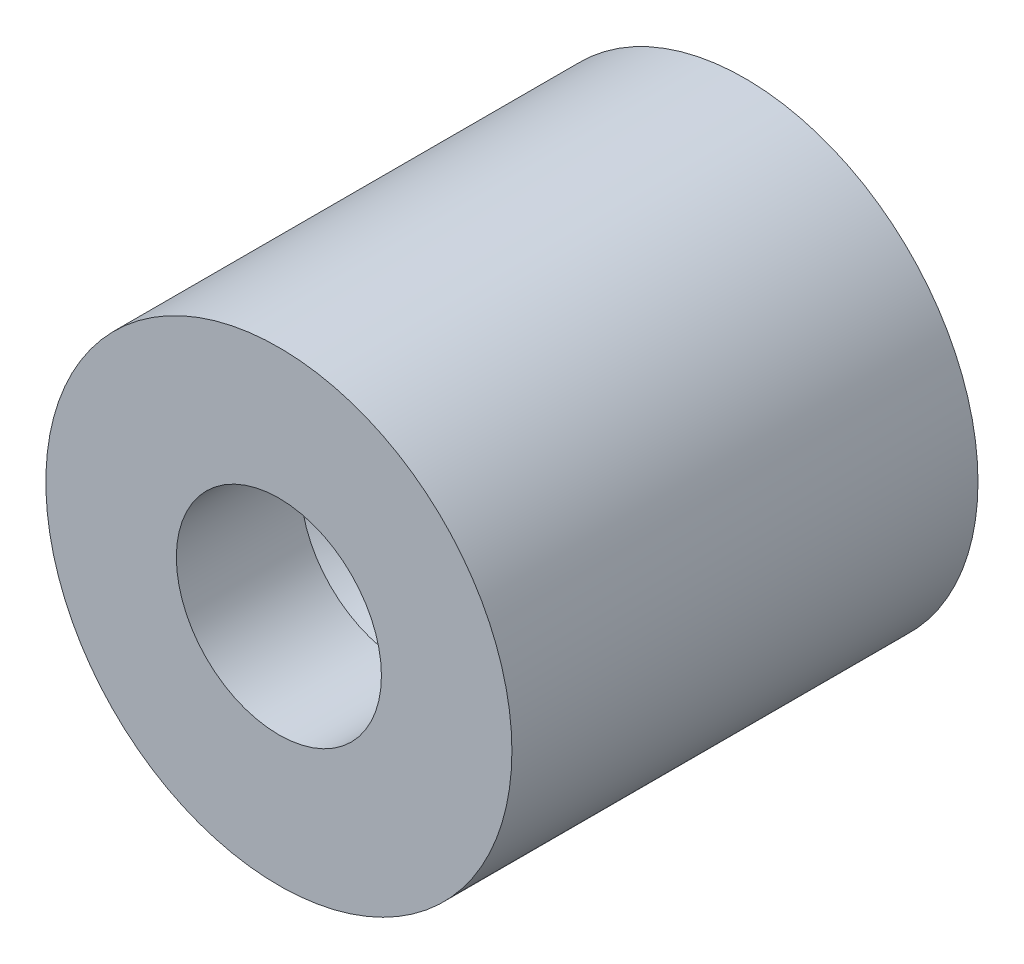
ISO-10303-21;
HEADER;
FILE_DESCRIPTION(('STEP AP214'),'2;1');
FILE_NAME('part.step','',(''),(''),'','','');
FILE_SCHEMA(('AUTOMOTIVE_DESIGN { 1 0 10303 214 1 1 1 1 }'));
ENDSEC;
DATA;
#1=APPLICATION_CONTEXT('core data for automotive mechanical design processes');
#2=APPLICATION_PROTOCOL_DEFINITION('international standard','automotive_design',2000,#1);
#3=PRODUCT_CONTEXT('',#1,'mechanical');
#4=PRODUCT('Part','Part','',(#3));
#5=PRODUCT_RELATED_PRODUCT_CATEGORY('part','',(#4));
#6=PRODUCT_DEFINITION_FORMATION('','',#4);
#7=PRODUCT_DEFINITION_CONTEXT('part definition',#1,'design');
#8=PRODUCT_DEFINITION('design','',#6,#7);
#9=PRODUCT_DEFINITION_SHAPE('','',#8);
#10=(LENGTH_UNIT() NAMED_UNIT(*) SI_UNIT(.MILLI.,.METRE.));
#11=(NAMED_UNIT(*) PLANE_ANGLE_UNIT() SI_UNIT($,.RADIAN.));
#12=(NAMED_UNIT(*) SI_UNIT($,.STERADIAN.) SOLID_ANGLE_UNIT());
#13=UNCERTAINTY_MEASURE_WITH_UNIT(LENGTH_MEASURE(1.E-05),#10,'distance_accuracy_value','');
#14=(GEOMETRIC_REPRESENTATION_CONTEXT(3) GLOBAL_UNCERTAINTY_ASSIGNED_CONTEXT((#13)) GLOBAL_UNIT_ASSIGNED_CONTEXT((#10,
#11,#12)) REPRESENTATION_CONTEXT('',''));
#15=CARTESIAN_POINT('',(0.,0.,0.));
#16=DIRECTION('',(0.,0.,1.));
#17=DIRECTION('',(1.,0.,0.));
#18=AXIS2_PLACEMENT_3D('',#15,#16,#17);
#19=CARTESIAN_POINT('',(0.,0.,15.));
#20=DIRECTION('',(0.,0.,-1.));
#21=DIRECTION('',(-1.,0.,0.));
#22=AXIS2_PLACEMENT_3D('',#19,#20,#21);
#23=CYLINDRICAL_SURFACE('',#22,7.5);
#24=CARTESIAN_POINT('',(0.,0.,15.));
#25=DIRECTION('',(0.,0.,1.));
#26=DIRECTION('',(1.,0.,0.));
#27=AXIS2_PLACEMENT_3D('',#24,#25,#26);
#28=CIRCLE('',#27,7.5);
#29=CARTESIAN_POINT('',(7.5,0.,15.));
#30=VERTEX_POINT('',#29);
#31=EDGE_CURVE('E11',#30,#30,#28,.T.);
#32=ORIENTED_EDGE('',*,*,#31,.F.);
#33=EDGE_LOOP('',(#32));
#34=FACE_BOUND('',#33,.T.);
#35=CARTESIAN_POINT('',(0.,0.,0.));
#36=DIRECTION('',(0.,0.,1.));
#37=DIRECTION('',(1.,0.,0.));
#38=AXIS2_PLACEMENT_3D('',#35,#36,#37);
#39=CIRCLE('',#38,7.5);
#40=CARTESIAN_POINT('',(7.5,0.,0.));
#41=VERTEX_POINT('',#40);
#42=EDGE_CURVE('E34',#41,#41,#39,.T.);
#43=ORIENTED_EDGE('',*,*,#42,.T.);
#44=EDGE_LOOP('',(#43));
#45=FACE_BOUND('',#44,.T.);
#46=ADVANCED_FACE('F31',(#34,#45),#23,.T.);
#47=CARTESIAN_POINT('',(0.,0.,15.));
#48=DIRECTION('',(0.,0.,1.));
#49=DIRECTION('',(1.,0.,0.));
#50=AXIS2_PLACEMENT_3D('',#47,#48,#49);
#51=PLANE('',#50);
#52=CARTESIAN_POINT('',(0.,0.,15.));
#53=DIRECTION('',(0.,0.,1.));
#54=DIRECTION('',(1.,0.,0.));
#55=AXIS2_PLACEMENT_3D('',#52,#53,#54);
#56=CIRCLE('',#55,3.3);
#57=CARTESIAN_POINT('',(3.3,0.,15.));
#58=VERTEX_POINT('',#57);
#59=EDGE_CURVE('E58',#58,#58,#56,.T.);
#60=ORIENTED_EDGE('',*,*,#59,.F.);
#61=EDGE_LOOP('',(#60));
#62=FACE_BOUND('',#61,.T.);
#63=ORIENTED_EDGE('',*,*,#31,.T.);
#64=EDGE_LOOP('',(#63));
#65=FACE_BOUND('',#64,.T.);
#66=ADVANCED_FACE('F73',(#62,#65),#51,.T.);
#67=CARTESIAN_POINT('',(0.,0.,0.));
#68=DIRECTION('',(0.,0.,1.));
#69=DIRECTION('',(1.,0.,0.));
#70=AXIS2_PLACEMENT_3D('',#67,#68,#69);
#71=PLANE('',#70);
#72=CARTESIAN_POINT('',(0.,0.,0.));
#73=DIRECTION('',(0.,0.,-1.));
#74=DIRECTION('',(-1.,0.,0.));
#75=AXIS2_PLACEMENT_3D('',#72,#73,#74);
#76=CIRCLE('',#75,3.29999999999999);
#77=CARTESIAN_POINT('',(-3.29999999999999,0.,0.));
#78=VERTEX_POINT('',#77);
#79=EDGE_CURVE('E55',#78,#78,#76,.T.);
#80=ORIENTED_EDGE('',*,*,#79,.F.);
#81=EDGE_LOOP('',(#80));
#82=FACE_BOUND('',#81,.T.);
#83=ORIENTED_EDGE('',*,*,#42,.F.);
#84=EDGE_LOOP('',(#83));
#85=FACE_BOUND('',#84,.T.);
#86=ADVANCED_FACE('F70',(#82,#85),#71,.F.);
#87=CARTESIAN_POINT('',(0.,0.,15.));
#88=DIRECTION('',(0.,0.,1.));
#89=DIRECTION('',(1.,0.,0.));
#90=AXIS2_PLACEMENT_3D('',#87,#88,#89);
#91=CYLINDRICAL_SURFACE('',#90,3.3);
#92=CARTESIAN_POINT('',(0.,0.,11.));
#93=DIRECTION('',(0.,0.,1.));
#94=DIRECTION('',(1.,0.,0.));
#95=AXIS2_PLACEMENT_3D('',#92,#93,#94);
#96=CIRCLE('',#95,3.3);
#97=CARTESIAN_POINT('',(3.3,0.,11.));
#98=VERTEX_POINT('',#97);
#99=EDGE_CURVE('E54',#98,#98,#96,.T.);
#100=ORIENTED_EDGE('',*,*,#99,.F.);
#101=EDGE_LOOP('',(#100));
#102=FACE_BOUND('',#101,.T.);
#103=ORIENTED_EDGE('',*,*,#59,.T.);
#104=EDGE_LOOP('',(#103));
#105=FACE_BOUND('',#104,.T.);
#106=ADVANCED_FACE('F72',(#102,#105),#91,.F.);
#107=CARTESIAN_POINT('',(0.,0.,11.));
#108=DIRECTION('',(0.,0.,1.));
#109=DIRECTION('',(1.,0.,0.));
#110=AXIS2_PLACEMENT_3D('',#107,#108,#109);
#111=CONICAL_SURFACE('',#110,3.3,1.02974425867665);
#112=CARTESIAN_POINT('',(0.,0.,9.01715995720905));
#113=VERTEX_POINT('',#112);
#114=VERTEX_LOOP('',#113);
#115=FACE_BOUND('',#114,.T.);
#116=ORIENTED_EDGE('',*,*,#99,.T.);
#117=EDGE_LOOP('',(#116));
#118=FACE_BOUND('',#117,.T.);
#119=ADVANCED_FACE('F48',(#115,#118),#111,.F.);
#120=CARTESIAN_POINT('',(0.,0.,4.));
#121=DIRECTION('',(0.,0.,-1.));
#122=DIRECTION('',(-1.,0.,0.));
#123=AXIS2_PLACEMENT_3D('',#120,#121,#122);
#124=CONICAL_SURFACE('',#123,3.3,1.02974425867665);
#125=CARTESIAN_POINT('',(0.,0.,5.98284004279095));
#126=VERTEX_POINT('',#125);
#127=VERTEX_LOOP('',#126);
#128=FACE_BOUND('',#127,.T.);
#129=CARTESIAN_POINT('',(0.,0.,4.));
#130=DIRECTION('',(0.,0.,-1.));
#131=DIRECTION('',(-1.,0.,0.));
#132=AXIS2_PLACEMENT_3D('',#129,#130,#131);
#133=CIRCLE('',#132,3.3);
#134=CARTESIAN_POINT('',(-3.3,0.,4.));
#135=VERTEX_POINT('',#134);
#136=EDGE_CURVE('E52',#135,#135,#133,.T.);
#137=ORIENTED_EDGE('',*,*,#136,.T.);
#138=EDGE_LOOP('',(#137));
#139=FACE_BOUND('',#138,.T.);
#140=ADVANCED_FACE('F44',(#128,#139),#124,.F.);
#141=CARTESIAN_POINT('',(0.,0.,0.));
#142=DIRECTION('',(0.,0.,-1.));
#143=DIRECTION('',(-1.,0.,0.));
#144=AXIS2_PLACEMENT_3D('',#141,#142,#143);
#145=CYLINDRICAL_SURFACE('',#144,3.29999999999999);
#146=ORIENTED_EDGE('',*,*,#136,.F.);
#147=EDGE_LOOP('',(#146));
#148=FACE_BOUND('',#147,.T.);
#149=ORIENTED_EDGE('',*,*,#79,.T.);
#150=EDGE_LOOP('',(#149));
#151=FACE_BOUND('',#150,.T.);
#152=ADVANCED_FACE('F47',(#148,#151),#145,.F.);
#153=CLOSED_SHELL('',(#46,#66,#86,#106,#119,#140,#152));
#154=MANIFOLD_SOLID_BREP('B2',#153);
#155=ADVANCED_BREP_SHAPE_REPRESENTATION('',(#18,#154),#14);
#156=SHAPE_DEFINITION_REPRESENTATION(#9,#155);
ENDSEC;
END-ISO-10303-21;
